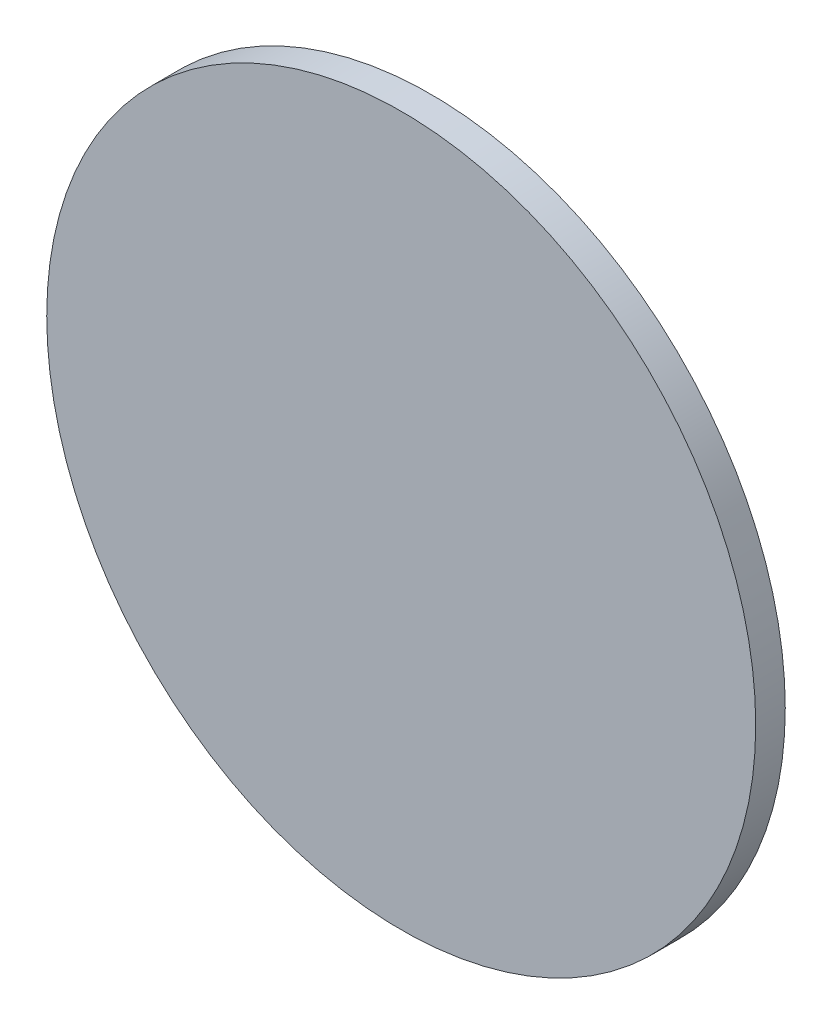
ISO-10303-21;
HEADER;
FILE_DESCRIPTION(('STEP AP214'),'2;1');
FILE_NAME('part.step','',(''),(''),'','','');
FILE_SCHEMA(('AUTOMOTIVE_DESIGN { 1 0 10303 214 1 1 1 1 }'));
ENDSEC;
DATA;
#1=APPLICATION_CONTEXT('core data for automotive mechanical design processes');
#2=APPLICATION_PROTOCOL_DEFINITION('international standard','automotive_design',2000,#1);
#3=PRODUCT_CONTEXT('',#1,'mechanical');
#4=PRODUCT('Part','Part','',(#3));
#5=PRODUCT_RELATED_PRODUCT_CATEGORY('part','',(#4));
#6=PRODUCT_DEFINITION_FORMATION('','',#4);
#7=PRODUCT_DEFINITION_CONTEXT('part definition',#1,'design');
#8=PRODUCT_DEFINITION('design','',#6,#7);
#9=PRODUCT_DEFINITION_SHAPE('','',#8);
#10=(LENGTH_UNIT() NAMED_UNIT(*) SI_UNIT(.MILLI.,.METRE.));
#11=(NAMED_UNIT(*) PLANE_ANGLE_UNIT() SI_UNIT($,.RADIAN.));
#12=(NAMED_UNIT(*) SI_UNIT($,.STERADIAN.) SOLID_ANGLE_UNIT());
#13=UNCERTAINTY_MEASURE_WITH_UNIT(LENGTH_MEASURE(1.E-05),#10,'distance_accuracy_value','');
#14=(GEOMETRIC_REPRESENTATION_CONTEXT(3) GLOBAL_UNCERTAINTY_ASSIGNED_CONTEXT((#13)) GLOBAL_UNIT_ASSIGNED_CONTEXT((#10,
#11,#12)) REPRESENTATION_CONTEXT('',''));
#15=CARTESIAN_POINT('',(0.,0.,0.));
#16=DIRECTION('',(0.,0.,1.));
#17=DIRECTION('',(1.,0.,0.));
#18=AXIS2_PLACEMENT_3D('',#15,#16,#17);
#19=CARTESIAN_POINT('',(0.,0.,0.0254));
#20=DIRECTION('',(0.,0.,1.));
#21=DIRECTION('',(1.,0.,0.));
#22=AXIS2_PLACEMENT_3D('',#19,#20,#21);
#23=PLANE('',#22);
#24=CARTESIAN_POINT('',(0.,0.,0.0254));
#25=DIRECTION('',(0.,0.,1.));
#26=DIRECTION('',(1.,0.,0.));
#27=AXIS2_PLACEMENT_3D('',#24,#25,#26);
#28=CIRCLE('',#27,0.3048);
#29=CARTESIAN_POINT('',(0.3048,0.,0.0254));
#30=VERTEX_POINT('',#29);
#31=EDGE_CURVE('E11',#30,#30,#28,.T.);
#32=ORIENTED_EDGE('',*,*,#31,.T.);
#33=EDGE_LOOP('',(#32));
#34=FACE_BOUND('',#33,.T.);
#35=ADVANCED_FACE('F17',(#34),#23,.T.);
#36=CARTESIAN_POINT('',(0.,0.,0.));
#37=DIRECTION('',(0.,0.,1.));
#38=DIRECTION('',(1.,0.,0.));
#39=AXIS2_PLACEMENT_3D('',#36,#37,#38);
#40=PLANE('',#39);
#41=CARTESIAN_POINT('',(0.,0.,0.));
#42=DIRECTION('',(0.,0.,1.));
#43=DIRECTION('',(1.,0.,0.));
#44=AXIS2_PLACEMENT_3D('',#41,#42,#43);
#45=CIRCLE('',#44,0.3048);
#46=CARTESIAN_POINT('',(0.3048,0.,0.));
#47=VERTEX_POINT('',#46);
#48=EDGE_CURVE('E42',#47,#47,#45,.T.);
#49=ORIENTED_EDGE('',*,*,#48,.F.);
#50=EDGE_LOOP('',(#49));
#51=FACE_BOUND('',#50,.T.);
#52=ADVANCED_FACE('F64',(#51),#40,.F.);
#53=CARTESIAN_POINT('',(0.,0.,0.));
#54=DIRECTION('',(0.,0.,-1.));
#55=DIRECTION('',(1.,0.,0.));
#56=AXIS2_PLACEMENT_3D('',#53,#54,#55);
#57=CYLINDRICAL_SURFACE('',#56,0.3048);
#58=ORIENTED_EDGE('',*,*,#48,.T.);
#59=DIRECTION('',(0.,0.,1.));
#60=VECTOR('',#59,1.);
#61=CARTESIAN_POINT('',(0.3048,0.,0.));
#62=LINE('',#61,#60);
#63=EDGE_CURVE('E25',#47,#30,#62,.T.);
#64=ORIENTED_EDGE('',*,*,#63,.T.);
#65=ORIENTED_EDGE('',*,*,#31,.F.);
#66=ORIENTED_EDGE('',*,*,#63,.F.);
#67=EDGE_LOOP('',(#58,#64,#65,#66));
#68=FACE_BOUND('',#67,.T.);
#69=ADVANCED_FACE('F40',(#68),#57,.T.);
#70=CLOSED_SHELL('',(#35,#52,#69));
#71=MANIFOLD_SOLID_BREP('B1',#70);
#72=ADVANCED_BREP_SHAPE_REPRESENTATION('',(#18,#71),#14);
#73=SHAPE_DEFINITION_REPRESENTATION(#9,#72);
ENDSEC;
END-ISO-10303-21;
